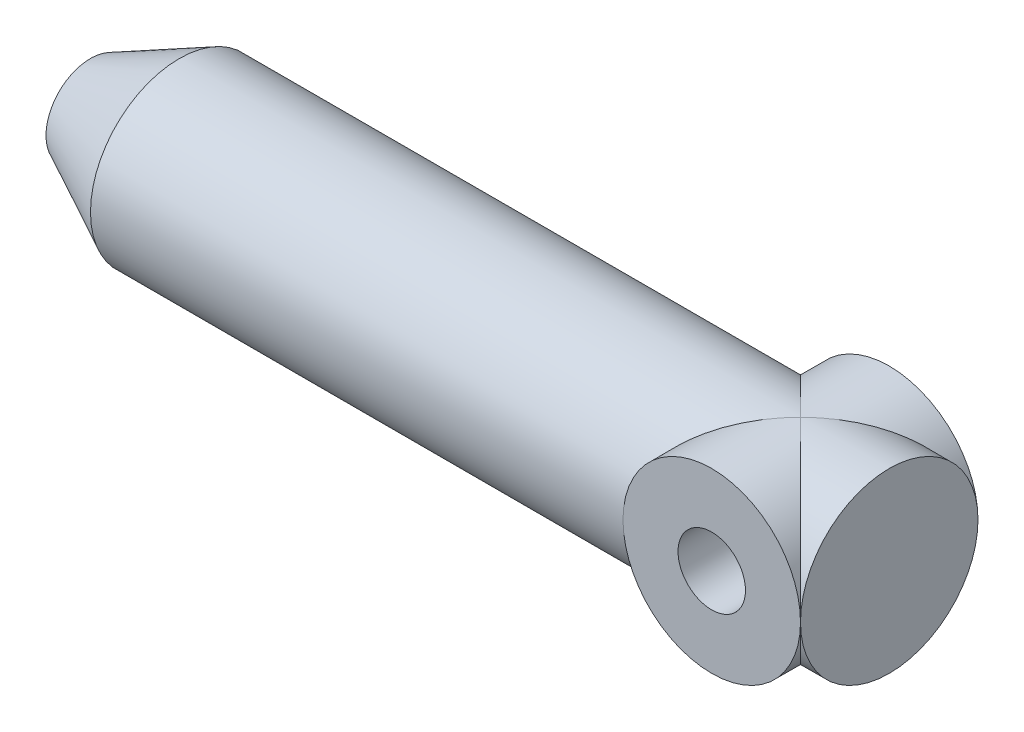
from build123d import *

# Parameters (mm, degrees)
SKETCH2_R           = 3.175
CUT_EXTRUDE1_DEPTH  = 44.45
SKETCH3_R           = 6.35
BOSS_EXTRUDE1_DEPTH = 6.35
SKETCH4_R           = 2.413
CUT_EXTRUDE2_DEPTH  = 59.887477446


with BuildPart() as part:
    # Sketch1 → Revolve1 (revolve)
    with BuildSketch(Plane.XY, mode=Mode.PRIVATE) as revolve1_sk:
        Polygon((6.35, 6.35), (0, 3.18262), (0, 0), (57.15, 0), (57.15, 6.35), align=None)
    revolve(revolve1_sk.sketch.rotate(Axis((0, 0, 0), (1, 0, 0)), 90), axis=Axis((0, 0, 0), (1, 0, 0)))

    # Sketch2 → Cut-Extrude1 (cut)
    with BuildSketch(Plane.ZY):
        Circle(SKETCH2_R)
    extrude(amount=-CUT_EXTRUDE1_DEPTH, mode=Mode.SUBTRACT)

    # Sketch3 → Boss-Extrude1 (add, symmetric)
    with BuildSketch(Plane.XY):
        with Locations((50.8, 0)):
            Circle(SKETCH3_R)
    extrude(amount=BOSS_EXTRUDE1_DEPTH, both=True)

    # Sketch4 → Cut-Extrude2 (cut, through all)
    with BuildSketch(Plane.XY.offset(6.35)):
        with Locations((50.8, 0)):
            Circle(SKETCH4_R)
    extrude(amount=-CUT_EXTRUDE2_DEPTH, mode=Mode.SUBTRACT)


solid = part.part
